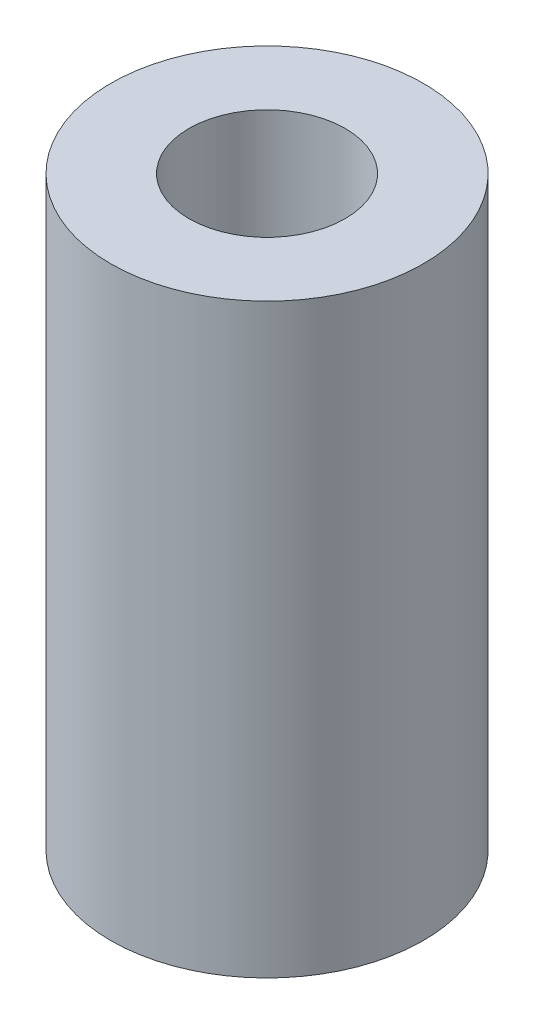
ISO-10303-21;
HEADER;
FILE_DESCRIPTION(('STEP AP214'),'2;1');
FILE_NAME('part.step','',(''),(''),'','','');
FILE_SCHEMA(('AUTOMOTIVE_DESIGN { 1 0 10303 214 1 1 1 1 }'));
ENDSEC;
DATA;
#1=APPLICATION_CONTEXT('core data for automotive mechanical design processes');
#2=APPLICATION_PROTOCOL_DEFINITION('international standard','automotive_design',2000,#1);
#3=PRODUCT_CONTEXT('',#1,'mechanical');
#4=PRODUCT('Part','Part','',(#3));
#5=PRODUCT_RELATED_PRODUCT_CATEGORY('part','',(#4));
#6=PRODUCT_DEFINITION_FORMATION('','',#4);
#7=PRODUCT_DEFINITION_CONTEXT('part definition',#1,'design');
#8=PRODUCT_DEFINITION('design','',#6,#7);
#9=PRODUCT_DEFINITION_SHAPE('','',#8);
#10=(LENGTH_UNIT() NAMED_UNIT(*) SI_UNIT(.MILLI.,.METRE.));
#11=(NAMED_UNIT(*) PLANE_ANGLE_UNIT() SI_UNIT($,.RADIAN.));
#12=(NAMED_UNIT(*) SI_UNIT($,.STERADIAN.) SOLID_ANGLE_UNIT());
#13=UNCERTAINTY_MEASURE_WITH_UNIT(LENGTH_MEASURE(1.E-05),#10,'distance_accuracy_value','');
#14=(GEOMETRIC_REPRESENTATION_CONTEXT(3) GLOBAL_UNCERTAINTY_ASSIGNED_CONTEXT((#13)) GLOBAL_UNIT_ASSIGNED_CONTEXT((#10,
#11,#12)) REPRESENTATION_CONTEXT('',''));
#15=CARTESIAN_POINT('',(0.,0.,0.));
#16=DIRECTION('',(0.,0.,1.));
#17=DIRECTION('',(1.,0.,0.));
#18=AXIS2_PLACEMENT_3D('',#15,#16,#17);
#19=CARTESIAN_POINT('',(4.,7.,0.));
#20=DIRECTION('',(0.,-1.,0.));
#21=DIRECTION('',(0.,0.,-1.));
#22=AXIS2_PLACEMENT_3D('',#19,#20,#21);
#23=PLANE('',#22);
#24=CARTESIAN_POINT('',(0.,7.,0.));
#25=DIRECTION('',(0.,1.,0.));
#26=DIRECTION('',(0.,0.,1.));
#27=AXIS2_PLACEMENT_3D('',#24,#25,#26);
#28=CIRCLE('',#27,2.);
#29=CARTESIAN_POINT('',(0.,7.,2.00000000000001));
#30=VERTEX_POINT('',#29);
#31=EDGE_CURVE('E57',#30,#30,#28,.T.);
#32=ORIENTED_EDGE('',*,*,#31,.F.);
#33=EDGE_LOOP('',(#32));
#34=FACE_BOUND('',#33,.T.);
#35=CARTESIAN_POINT('',(0.,7.,0.));
#36=DIRECTION('',(0.,1.,0.));
#37=DIRECTION('',(0.,0.,1.));
#38=AXIS2_PLACEMENT_3D('',#35,#36,#37);
#39=CIRCLE('',#38,4.00000000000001);
#40=CARTESIAN_POINT('',(0.,7.,4.00000000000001));
#41=VERTEX_POINT('',#40);
#42=EDGE_CURVE('E10',#41,#41,#39,.T.);
#43=ORIENTED_EDGE('',*,*,#42,.T.);
#44=EDGE_LOOP('',(#43));
#45=FACE_BOUND('',#44,.T.);
#46=ADVANCED_FACE('F32',(#34,#45),#23,.F.);
#47=CARTESIAN_POINT('',(0.,44.1273672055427,0.));
#48=DIRECTION('',(0.,1.,0.));
#49=DIRECTION('',(0.,0.,1.));
#50=AXIS2_PLACEMENT_3D('',#47,#48,#49);
#51=CYLINDRICAL_SURFACE('',#50,4.00000000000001);
#52=ORIENTED_EDGE('',*,*,#42,.F.);
#53=EDGE_LOOP('',(#52));
#54=FACE_BOUND('',#53,.T.);
#55=CARTESIAN_POINT('',(0.,-8.,0.));
#56=DIRECTION('',(0.,1.,0.));
#57=DIRECTION('',(0.,0.,1.));
#58=AXIS2_PLACEMENT_3D('',#55,#56,#57);
#59=CIRCLE('',#58,4.00000000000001);
#60=CARTESIAN_POINT('',(0.,-8.,4.00000000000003));
#61=VERTEX_POINT('',#60);
#62=EDGE_CURVE('E38',#61,#61,#59,.T.);
#63=ORIENTED_EDGE('',*,*,#62,.T.);
#64=EDGE_LOOP('',(#63));
#65=FACE_BOUND('',#64,.T.);
#66=ADVANCED_FACE('F64',(#54,#65),#51,.T.);
#67=CARTESIAN_POINT('',(2.00000000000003,-8.,0.));
#68=DIRECTION('',(0.,1.,0.));
#69=DIRECTION('',(0.,0.,1.));
#70=AXIS2_PLACEMENT_3D('',#67,#68,#69);
#71=PLANE('',#70);
#72=ORIENTED_EDGE('',*,*,#62,.F.);
#73=EDGE_LOOP('',(#72));
#74=FACE_BOUND('',#73,.T.);
#75=CARTESIAN_POINT('',(0.,-8.,0.));
#76=DIRECTION('',(0.,1.,0.));
#77=DIRECTION('',(0.,0.,1.));
#78=AXIS2_PLACEMENT_3D('',#75,#76,#77);
#79=CIRCLE('',#78,2.00000000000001);
#80=CARTESIAN_POINT('',(0.,-8.,2.00000000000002));
#81=VERTEX_POINT('',#80);
#82=EDGE_CURVE('E42',#81,#81,#79,.T.);
#83=ORIENTED_EDGE('',*,*,#82,.T.);
#84=EDGE_LOOP('',(#83));
#85=FACE_BOUND('',#84,.T.);
#86=ADVANCED_FACE('F68',(#74,#85),#71,.F.);
#87=CARTESIAN_POINT('',(0.,-7.5,0.));
#88=DIRECTION('',(0.,-1.,0.));
#89=DIRECTION('',(0.,0.,-1.));
#90=AXIS2_PLACEMENT_3D('',#87,#88,#89);
#91=CONICAL_SURFACE('',#90,1.50000000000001,0.785398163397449);
#92=ORIENTED_EDGE('',*,*,#82,.F.);
#93=EDGE_LOOP('',(#92));
#94=FACE_BOUND('',#93,.T.);
#95=CARTESIAN_POINT('',(0.,-7.5,0.));
#96=DIRECTION('',(0.,1.,0.));
#97=DIRECTION('',(0.,0.,1.));
#98=AXIS2_PLACEMENT_3D('',#95,#96,#97);
#99=CIRCLE('',#98,1.50000000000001);
#100=CARTESIAN_POINT('',(0.,-7.5,1.50000000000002));
#101=VERTEX_POINT('',#100);
#102=EDGE_CURVE('E46',#101,#101,#99,.T.);
#103=ORIENTED_EDGE('',*,*,#102,.T.);
#104=EDGE_LOOP('',(#103));
#105=FACE_BOUND('',#104,.T.);
#106=ADVANCED_FACE('F73',(#94,#105),#91,.F.);
#107=CARTESIAN_POINT('',(0.,44.1273672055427,0.));
#108=DIRECTION('',(0.,1.,0.));
#109=DIRECTION('',(0.,0.,1.));
#110=AXIS2_PLACEMENT_3D('',#107,#108,#109);
#111=CYLINDRICAL_SURFACE('',#110,1.50000000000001);
#112=ORIENTED_EDGE('',*,*,#102,.F.);
#113=EDGE_LOOP('',(#112));
#114=FACE_BOUND('',#113,.T.);
#115=CARTESIAN_POINT('',(0.,0.,0.));
#116=DIRECTION('',(0.,1.,0.));
#117=DIRECTION('',(0.,0.,1.));
#118=AXIS2_PLACEMENT_3D('',#115,#116,#117);
#119=CIRCLE('',#118,1.50000000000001);
#120=CARTESIAN_POINT('',(0.,0.,1.50000000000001));
#121=VERTEX_POINT('',#120);
#122=EDGE_CURVE('E51',#121,#121,#119,.T.);
#123=ORIENTED_EDGE('',*,*,#122,.T.);
#124=EDGE_LOOP('',(#123));
#125=FACE_BOUND('',#124,.T.);
#126=ADVANCED_FACE('F79',(#114,#125),#111,.F.);
#127=CARTESIAN_POINT('',(2.00000000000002,0.,0.));
#128=DIRECTION('',(0.,-1.,0.));
#129=DIRECTION('',(0.,0.,-1.));
#130=AXIS2_PLACEMENT_3D('',#127,#128,#129);
#131=PLANE('',#130);
#132=ORIENTED_EDGE('',*,*,#122,.F.);
#133=EDGE_LOOP('',(#132));
#134=FACE_BOUND('',#133,.T.);
#135=CARTESIAN_POINT('',(0.,0.,0.));
#136=DIRECTION('',(0.,1.,0.));
#137=DIRECTION('',(0.,0.,1.));
#138=AXIS2_PLACEMENT_3D('',#135,#136,#137);
#139=CIRCLE('',#138,2.);
#140=CARTESIAN_POINT('',(0.,0.,2.00000000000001));
#141=VERTEX_POINT('',#140);
#142=EDGE_CURVE('E54',#141,#141,#139,.T.);
#143=ORIENTED_EDGE('',*,*,#142,.T.);
#144=EDGE_LOOP('',(#143));
#145=FACE_BOUND('',#144,.T.);
#146=ADVANCED_FACE('F83',(#134,#145),#131,.F.);
#147=CARTESIAN_POINT('',(0.,44.1273672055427,0.));
#148=DIRECTION('',(0.,1.,0.));
#149=DIRECTION('',(0.,0.,1.));
#150=AXIS2_PLACEMENT_3D('',#147,#148,#149);
#151=CYLINDRICAL_SURFACE('',#150,2.);
#152=ORIENTED_EDGE('',*,*,#142,.F.);
#153=EDGE_LOOP('',(#152));
#154=FACE_BOUND('',#153,.T.);
#155=ORIENTED_EDGE('',*,*,#31,.T.);
#156=EDGE_LOOP('',(#155));
#157=FACE_BOUND('',#156,.T.);
#158=ADVANCED_FACE('F61',(#154,#157),#151,.F.);
#159=CLOSED_SHELL('',(#46,#66,#86,#106,#126,#146,#158));
#160=MANIFOLD_SOLID_BREP('B2',#159);
#161=ADVANCED_BREP_SHAPE_REPRESENTATION('',(#18,#160),#14);
#162=SHAPE_DEFINITION_REPRESENTATION(#9,#161);
ENDSEC;
END-ISO-10303-21;
